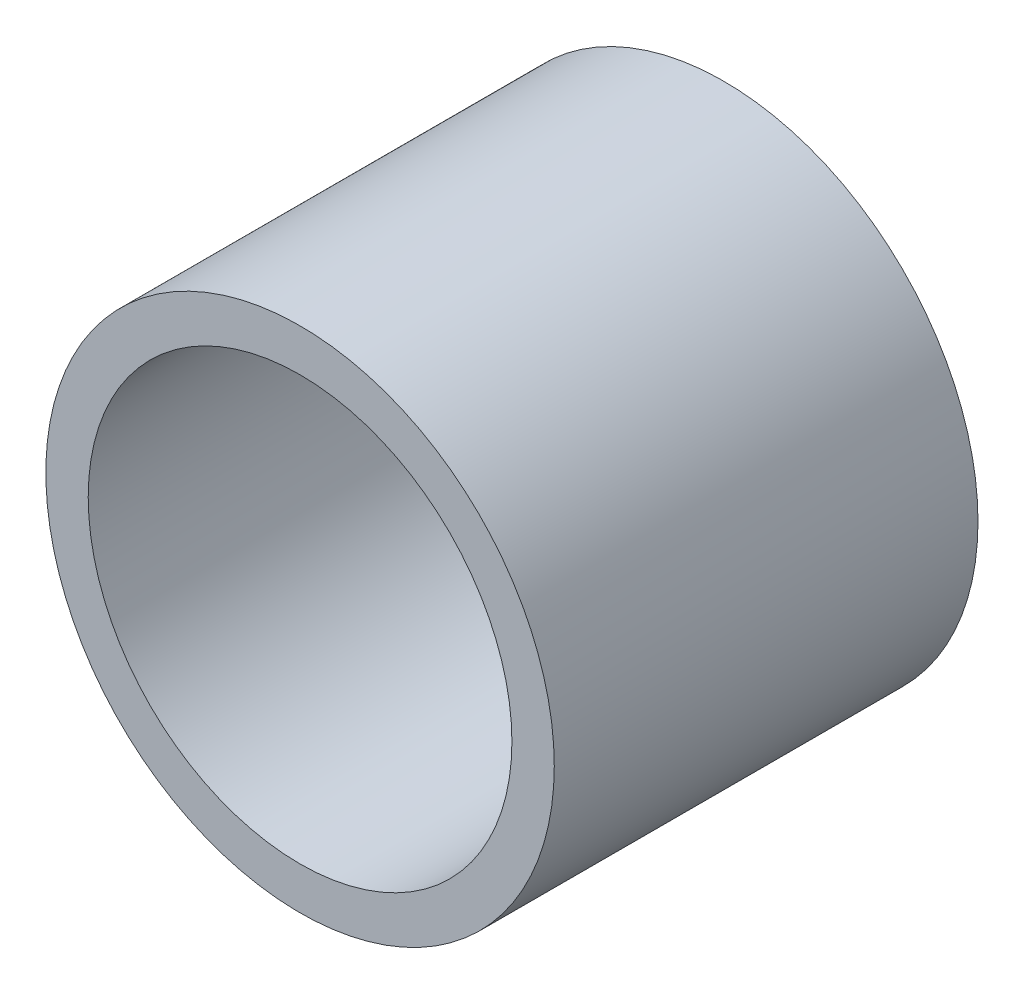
from build123d import *

# Parameters (mm, degrees)
ESQUISSE1_R      = 6
ESQUISSE1_R_2    = 5
EXTRUSION2_DEPTH = 10


with BuildPart() as part:
    # Esquisse1 → Extrusion2 (new body)
    with BuildSketch(Plane.XY):
        Circle(ESQUISSE1_R)
        Circle(ESQUISSE1_R_2, mode=Mode.SUBTRACT)
    extrude(amount=EXTRUSION2_DEPTH)


solid = part.part
